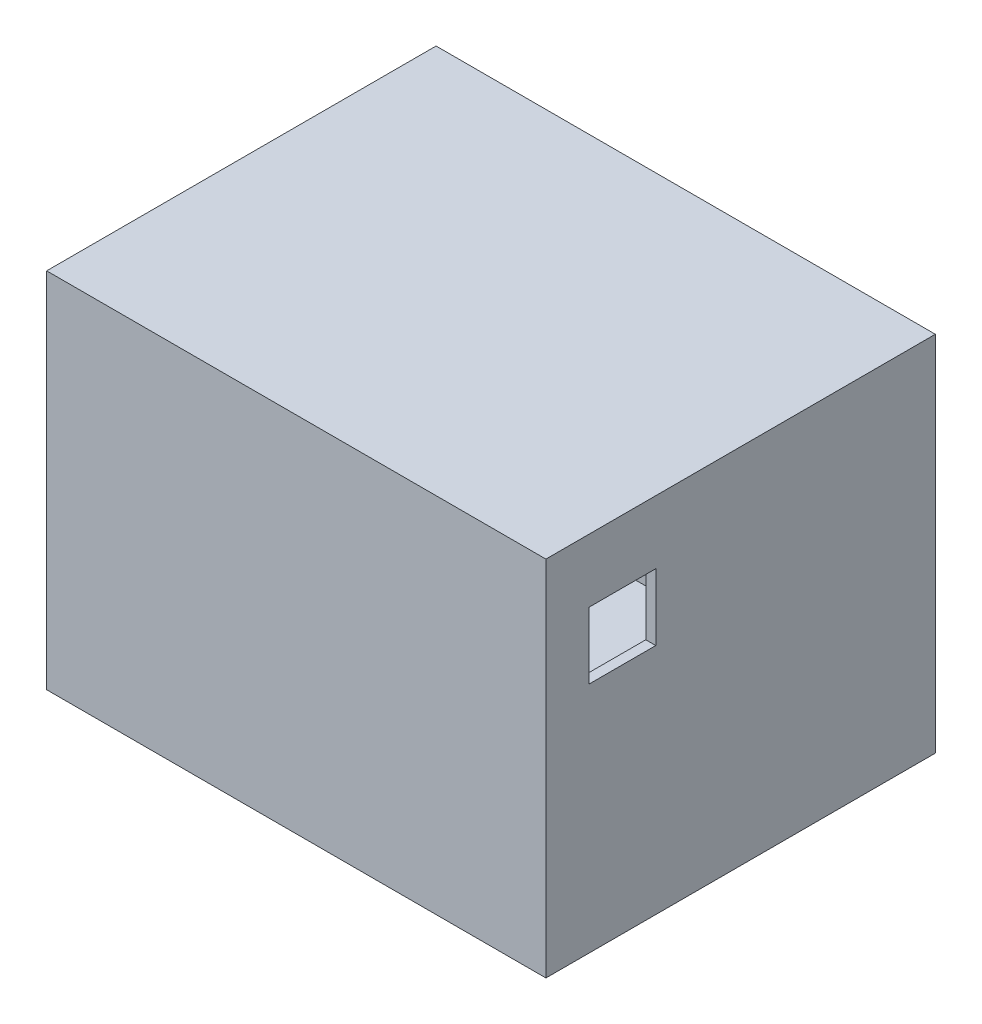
ISO-10303-21;
HEADER;
FILE_DESCRIPTION(('STEP AP214'),'2;1');
FILE_NAME('part.step','',(''),(''),'','','');
FILE_SCHEMA(('AUTOMOTIVE_DESIGN { 1 0 10303 214 1 1 1 1 }'));
ENDSEC;
DATA;
#1=APPLICATION_CONTEXT('core data for automotive mechanical design processes');
#2=APPLICATION_PROTOCOL_DEFINITION('international standard','automotive_design',2000,#1);
#3=PRODUCT_CONTEXT('',#1,'mechanical');
#4=PRODUCT('Part','Part','',(#3));
#5=PRODUCT_RELATED_PRODUCT_CATEGORY('part','',(#4));
#6=PRODUCT_DEFINITION_FORMATION('','',#4);
#7=PRODUCT_DEFINITION_CONTEXT('part definition',#1,'design');
#8=PRODUCT_DEFINITION('design','',#6,#7);
#9=PRODUCT_DEFINITION_SHAPE('','',#8);
#10=(LENGTH_UNIT() NAMED_UNIT(*) SI_UNIT(.MILLI.,.METRE.));
#11=(NAMED_UNIT(*) PLANE_ANGLE_UNIT() SI_UNIT($,.RADIAN.));
#12=(NAMED_UNIT(*) SI_UNIT($,.STERADIAN.) SOLID_ANGLE_UNIT());
#13=UNCERTAINTY_MEASURE_WITH_UNIT(LENGTH_MEASURE(1.E-05),#10,'distance_accuracy_value','');
#14=(GEOMETRIC_REPRESENTATION_CONTEXT(3) GLOBAL_UNCERTAINTY_ASSIGNED_CONTEXT((#13)) GLOBAL_UNIT_ASSIGNED_CONTEXT((#10,
#11,#12)) REPRESENTATION_CONTEXT('',''));
#15=CARTESIAN_POINT('',(0.,0.,0.));
#16=DIRECTION('',(0.,0.,1.));
#17=DIRECTION('',(1.,0.,0.));
#18=AXIS2_PLACEMENT_3D('',#15,#16,#17);
#19=CARTESIAN_POINT('',(-66.5581493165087,584.2,1846.68149316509));
#20=DIRECTION('',(1.,0.,0.));
#21=DIRECTION('',(0.,0.,-1.));
#22=AXIS2_PLACEMENT_3D('',#19,#20,#21);
#23=PLANE('',#22);
#24=DIRECTION('',(0.,-1.,0.));
#25=VECTOR('',#24,1.);
#26=CARTESIAN_POINT('',(-66.5581493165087,2324.1,1846.68149316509));
#27=LINE('',#26,#25);
#28=CARTESIAN_POINT('',(-66.5581493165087,2324.1,1846.68149316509));
#29=VERTEX_POINT('',#28);
#30=CARTESIAN_POINT('',(-66.5581493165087,584.2,1846.68149316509));
#31=VERTEX_POINT('',#30);
#32=EDGE_CURVE('E149',#29,#31,#27,.T.);
#33=ORIENTED_EDGE('',*,*,#32,.T.);
#34=DIRECTION('',(0.,0.,-1.));
#35=VECTOR('',#34,1.);
#36=CARTESIAN_POINT('',(-66.5581493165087,584.2,1846.68149316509));
#37=LINE('',#36,#35);
#38=CARTESIAN_POINT('',(-66.5581493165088,584.2,856.08149316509));
#39=VERTEX_POINT('',#38);
#40=EDGE_CURVE('E152',#31,#39,#37,.T.);
#41=ORIENTED_EDGE('',*,*,#40,.T.);
#42=DIRECTION('',(0.,1.,0.));
#43=VECTOR('',#42,1.);
#44=CARTESIAN_POINT('',(-66.5581493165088,2324.1,856.08149316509));
#45=LINE('',#44,#43);
#46=CARTESIAN_POINT('',(-66.5581493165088,2324.1,856.08149316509));
#47=VERTEX_POINT('',#46);
#48=EDGE_CURVE('E155',#39,#47,#45,.T.);
#49=ORIENTED_EDGE('',*,*,#48,.T.);
#50=DIRECTION('',(0.,0.,1.));
#51=VECTOR('',#50,1.);
#52=CARTESIAN_POINT('',(-66.5581493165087,2324.1,1846.68149316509));
#53=LINE('',#52,#51);
#54=EDGE_CURVE('E157',#47,#29,#53,.T.);
#55=ORIENTED_EDGE('',*,*,#54,.T.);
#56=EDGE_LOOP('',(#33,#41,#49,#55));
#57=FACE_BOUND('',#56,.T.);
#58=DIRECTION('',(0.,0.,-1.));
#59=VECTOR('',#58,1.);
#60=CARTESIAN_POINT('',(-66.5581493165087,673.1,1732.38149316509));
#61=LINE('',#60,#59);
#62=CARTESIAN_POINT('',(-66.5581493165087,673.1,1732.38149316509));
#63=VERTEX_POINT('',#62);
#64=CARTESIAN_POINT('',(-66.5581493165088,673.1,970.38149316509));
#65=VERTEX_POINT('',#64);
#66=EDGE_CURVE('E121',#63,#65,#61,.T.);
#67=ORIENTED_EDGE('',*,*,#66,.F.);
#68=DIRECTION('',(0.,-1.,0.));
#69=VECTOR('',#68,1.);
#70=CARTESIAN_POINT('',(-66.5581493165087,2197.1,1732.38149316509));
#71=LINE('',#70,#69);
#72=CARTESIAN_POINT('',(-66.5581493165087,2197.1,1732.38149316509));
#73=VERTEX_POINT('',#72);
#74=EDGE_CURVE('E113',#73,#63,#71,.T.);
#75=ORIENTED_EDGE('',*,*,#74,.F.);
#76=DIRECTION('',(0.,0.,1.));
#77=VECTOR('',#76,1.);
#78=CARTESIAN_POINT('',(-66.5581493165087,2197.1,1732.38149316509));
#79=LINE('',#78,#77);
#80=CARTESIAN_POINT('',(-66.5581493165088,2197.1,970.38149316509));
#81=VERTEX_POINT('',#80);
#82=EDGE_CURVE('E135',#81,#73,#79,.T.);
#83=ORIENTED_EDGE('',*,*,#82,.F.);
#84=DIRECTION('',(0.,1.,0.));
#85=VECTOR('',#84,1.);
#86=CARTESIAN_POINT('',(-66.5581493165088,2197.1,970.38149316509));
#87=LINE('',#86,#85);
#88=EDGE_CURVE('E133',#65,#81,#87,.T.);
#89=ORIENTED_EDGE('',*,*,#88,.F.);
#90=EDGE_LOOP('',(#67,#75,#83,#89));
#91=FACE_BOUND('',#90,.T.);
#92=ADVANCED_FACE('F48',(#57,#91),#23,.T.);
#93=CARTESIAN_POINT('',(-91.9581493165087,584.2,1846.68149316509));
#94=DIRECTION('',(1.,0.,0.));
#95=DIRECTION('',(0.,0.,-1.));
#96=AXIS2_PLACEMENT_3D('',#93,#94,#95);
#97=PLANE('',#96);
#98=DIRECTION('',(0.,-1.,0.));
#99=VECTOR('',#98,1.);
#100=CARTESIAN_POINT('',(-91.9581493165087,2324.1,1846.68149316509));
#101=LINE('',#100,#99);
#102=CARTESIAN_POINT('',(-91.9581493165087,2324.1,1846.68149316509));
#103=VERTEX_POINT('',#102);
#104=CARTESIAN_POINT('',(-91.9581493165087,584.2,1846.68149316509));
#105=VERTEX_POINT('',#104);
#106=EDGE_CURVE('E129',#103,#105,#101,.T.);
#107=ORIENTED_EDGE('',*,*,#106,.F.);
#108=DIRECTION('',(0.,0.,1.));
#109=VECTOR('',#108,1.);
#110=CARTESIAN_POINT('',(-91.9581493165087,2324.1,1846.68149316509));
#111=LINE('',#110,#109);
#112=CARTESIAN_POINT('',(-91.9581493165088,2324.1,856.08149316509));
#113=VERTEX_POINT('',#112);
#114=EDGE_CURVE('E153',#113,#103,#111,.T.);
#115=ORIENTED_EDGE('',*,*,#114,.F.);
#116=DIRECTION('',(0.,1.,0.));
#117=VECTOR('',#116,1.);
#118=CARTESIAN_POINT('',(-91.9581493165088,2324.1,856.08149316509));
#119=LINE('',#118,#117);
#120=CARTESIAN_POINT('',(-91.9581493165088,584.2,856.08149316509));
#121=VERTEX_POINT('',#120);
#122=EDGE_CURVE('E164',#121,#113,#119,.T.);
#123=ORIENTED_EDGE('',*,*,#122,.F.);
#124=DIRECTION('',(0.,0.,-1.));
#125=VECTOR('',#124,1.);
#126=CARTESIAN_POINT('',(-91.9581493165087,584.2,1846.68149316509));
#127=LINE('',#126,#125);
#128=EDGE_CURVE('E162',#105,#121,#127,.T.);
#129=ORIENTED_EDGE('',*,*,#128,.F.);
#130=EDGE_LOOP('',(#107,#115,#123,#129));
#131=FACE_BOUND('',#130,.T.);
#132=DIRECTION('',(0.,-1.,0.));
#133=VECTOR('',#132,1.);
#134=CARTESIAN_POINT('',(-91.9581493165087,2197.1,1732.38149316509));
#135=LINE('',#134,#133);
#136=CARTESIAN_POINT('',(-91.9581493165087,2197.1,1732.38149316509));
#137=VERTEX_POINT('',#136);
#138=CARTESIAN_POINT('',(-91.9581493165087,673.1,1732.38149316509));
#139=VERTEX_POINT('',#138);
#140=EDGE_CURVE('E71',#137,#139,#135,.T.);
#141=ORIENTED_EDGE('',*,*,#140,.T.);
#142=DIRECTION('',(0.,0.,-1.));
#143=VECTOR('',#142,1.);
#144=CARTESIAN_POINT('',(-91.9581493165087,673.1,1732.38149316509));
#145=LINE('',#144,#143);
#146=CARTESIAN_POINT('',(-91.9581493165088,673.1,970.38149316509));
#147=VERTEX_POINT('',#146);
#148=EDGE_CURVE('E128',#139,#147,#145,.T.);
#149=ORIENTED_EDGE('',*,*,#148,.T.);
#150=DIRECTION('',(0.,1.,0.));
#151=VECTOR('',#150,1.);
#152=CARTESIAN_POINT('',(-91.9581493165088,2197.1,970.38149316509));
#153=LINE('',#152,#151);
#154=CARTESIAN_POINT('',(-91.9581493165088,2197.1,970.38149316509));
#155=VERTEX_POINT('',#154);
#156=EDGE_CURVE('E141',#147,#155,#153,.T.);
#157=ORIENTED_EDGE('',*,*,#156,.T.);
#158=DIRECTION('',(0.,0.,1.));
#159=VECTOR('',#158,1.);
#160=CARTESIAN_POINT('',(-91.9581493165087,2197.1,1732.38149316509));
#161=LINE('',#160,#159);
#162=EDGE_CURVE('E122',#155,#137,#161,.T.);
#163=ORIENTED_EDGE('',*,*,#162,.T.);
#164=EDGE_LOOP('',(#141,#149,#157,#163));
#165=FACE_BOUND('',#164,.T.);
#166=ADVANCED_FACE('F182',(#131,#165),#97,.F.);
#167=CARTESIAN_POINT('',(-66.5581493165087,2324.1,1846.68149316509));
#168=DIRECTION('',(0.,0.,-1.));
#169=DIRECTION('',(0.,1.,0.));
#170=AXIS2_PLACEMENT_3D('',#167,#168,#169);
#171=PLANE('',#170);
#172=ORIENTED_EDGE('',*,*,#106,.T.);
#173=DIRECTION('',(-1.,0.,0.));
#174=VECTOR('',#173,1.);
#175=CARTESIAN_POINT('',(-66.5581493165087,584.2,1846.68149316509));
#176=LINE('',#175,#174);
#177=EDGE_CURVE('E12',#31,#105,#176,.T.);
#178=ORIENTED_EDGE('',*,*,#177,.F.);
#179=ORIENTED_EDGE('',*,*,#32,.F.);
#180=DIRECTION('',(-1.,0.,0.));
#181=VECTOR('',#180,1.);
#182=CARTESIAN_POINT('',(-66.5581493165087,2324.1,1846.68149316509));
#183=LINE('',#182,#181);
#184=EDGE_CURVE('E159',#29,#103,#183,.T.);
#185=ORIENTED_EDGE('',*,*,#184,.T.);
#186=EDGE_LOOP('',(#172,#178,#179,#185));
#187=FACE_BOUND('',#186,.T.);
#188=ADVANCED_FACE('F50',(#187),#171,.F.);
#189=CARTESIAN_POINT('',(-66.5581493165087,584.2,1846.68149316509));
#190=DIRECTION('',(0.,1.,0.));
#191=DIRECTION('',(0.,0.,1.));
#192=AXIS2_PLACEMENT_3D('',#189,#190,#191);
#193=PLANE('',#192);
#194=ORIENTED_EDGE('',*,*,#128,.T.);
#195=DIRECTION('',(-1.,0.,0.));
#196=VECTOR('',#195,1.);
#197=CARTESIAN_POINT('',(-66.5581493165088,584.2,856.08149316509));
#198=LINE('',#197,#196);
#199=EDGE_CURVE('E56',#39,#121,#198,.T.);
#200=ORIENTED_EDGE('',*,*,#199,.F.);
#201=ORIENTED_EDGE('',*,*,#40,.F.);
#202=ORIENTED_EDGE('',*,*,#177,.T.);
#203=EDGE_LOOP('',(#194,#200,#201,#202));
#204=FACE_BOUND('',#203,.T.);
#205=ADVANCED_FACE('F192',(#204),#193,.F.);
#206=CARTESIAN_POINT('',(-66.5581493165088,2324.1,856.08149316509));
#207=DIRECTION('',(0.,0.,1.));
#208=DIRECTION('',(1.,0.,0.));
#209=AXIS2_PLACEMENT_3D('',#206,#207,#208);
#210=PLANE('',#209);
#211=ORIENTED_EDGE('',*,*,#122,.T.);
#212=DIRECTION('',(-1.,0.,0.));
#213=VECTOR('',#212,1.);
#214=CARTESIAN_POINT('',(-66.5581493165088,2324.1,856.08149316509));
#215=LINE('',#214,#213);
#216=EDGE_CURVE('E169',#47,#113,#215,.T.);
#217=ORIENTED_EDGE('',*,*,#216,.F.);
#218=ORIENTED_EDGE('',*,*,#48,.F.);
#219=ORIENTED_EDGE('',*,*,#199,.T.);
#220=EDGE_LOOP('',(#211,#217,#218,#219));
#221=FACE_BOUND('',#220,.T.);
#222=ADVANCED_FACE('F176',(#221),#210,.F.);
#223=CARTESIAN_POINT('',(-66.5581493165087,2324.1,1846.68149316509));
#224=DIRECTION('',(0.,-1.,0.));
#225=DIRECTION('',(0.,0.,-1.));
#226=AXIS2_PLACEMENT_3D('',#223,#224,#225);
#227=PLANE('',#226);
#228=ORIENTED_EDGE('',*,*,#114,.T.);
#229=ORIENTED_EDGE('',*,*,#184,.F.);
#230=ORIENTED_EDGE('',*,*,#54,.F.);
#231=ORIENTED_EDGE('',*,*,#216,.T.);
#232=EDGE_LOOP('',(#228,#229,#230,#231));
#233=FACE_BOUND('',#232,.T.);
#234=ADVANCED_FACE('F186',(#233),#227,.F.);
#235=CARTESIAN_POINT('',(-66.5581493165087,2197.1,1732.38149316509));
#236=DIRECTION('',(0.,0.,-1.));
#237=DIRECTION('',(0.,1.,0.));
#238=AXIS2_PLACEMENT_3D('',#235,#236,#237);
#239=PLANE('',#238);
#240=ORIENTED_EDGE('',*,*,#140,.F.);
#241=DIRECTION('',(-1.,0.,0.));
#242=VECTOR('',#241,1.);
#243=CARTESIAN_POINT('',(-66.5581493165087,2197.1,1732.38149316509));
#244=LINE('',#243,#242);
#245=EDGE_CURVE('E117',#73,#137,#244,.T.);
#246=ORIENTED_EDGE('',*,*,#245,.F.);
#247=ORIENTED_EDGE('',*,*,#74,.T.);
#248=DIRECTION('',(-1.,0.,0.));
#249=VECTOR('',#248,1.);
#250=CARTESIAN_POINT('',(-66.5581493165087,673.1,1732.38149316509));
#251=LINE('',#250,#249);
#252=EDGE_CURVE('E116',#63,#139,#251,.T.);
#253=ORIENTED_EDGE('',*,*,#252,.T.);
#254=EDGE_LOOP('',(#240,#246,#247,#253));
#255=FACE_BOUND('',#254,.T.);
#256=ADVANCED_FACE('F115',(#255),#239,.T.);
#257=CARTESIAN_POINT('',(-66.5581493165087,673.1,1732.38149316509));
#258=DIRECTION('',(0.,1.,0.));
#259=DIRECTION('',(0.,0.,1.));
#260=AXIS2_PLACEMENT_3D('',#257,#258,#259);
#261=PLANE('',#260);
#262=ORIENTED_EDGE('',*,*,#148,.F.);
#263=ORIENTED_EDGE('',*,*,#252,.F.);
#264=ORIENTED_EDGE('',*,*,#66,.T.);
#265=DIRECTION('',(-1.,0.,0.));
#266=VECTOR('',#265,1.);
#267=CARTESIAN_POINT('',(-66.5581493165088,673.1,970.38149316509));
#268=LINE('',#267,#266);
#269=EDGE_CURVE('E130',#65,#147,#268,.T.);
#270=ORIENTED_EDGE('',*,*,#269,.T.);
#271=EDGE_LOOP('',(#262,#263,#264,#270));
#272=FACE_BOUND('',#271,.T.);
#273=ADVANCED_FACE('F125',(#272),#261,.T.);
#274=CARTESIAN_POINT('',(-66.5581493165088,2197.1,970.38149316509));
#275=DIRECTION('',(0.,0.,1.));
#276=DIRECTION('',(0.,-1.,0.));
#277=AXIS2_PLACEMENT_3D('',#274,#275,#276);
#278=PLANE('',#277);
#279=ORIENTED_EDGE('',*,*,#156,.F.);
#280=ORIENTED_EDGE('',*,*,#269,.F.);
#281=ORIENTED_EDGE('',*,*,#88,.T.);
#282=DIRECTION('',(-1.,0.,0.));
#283=VECTOR('',#282,1.);
#284=CARTESIAN_POINT('',(-66.5581493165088,2197.1,970.38149316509));
#285=LINE('',#284,#283);
#286=EDGE_CURVE('E63',#81,#155,#285,.T.);
#287=ORIENTED_EDGE('',*,*,#286,.T.);
#288=EDGE_LOOP('',(#279,#280,#281,#287));
#289=FACE_BOUND('',#288,.T.);
#290=ADVANCED_FACE('F215',(#289),#278,.T.);
#291=CARTESIAN_POINT('',(-66.5581493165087,2197.1,1732.38149316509));
#292=DIRECTION('',(0.,-1.,0.));
#293=DIRECTION('',(0.,0.,-1.));
#294=AXIS2_PLACEMENT_3D('',#291,#292,#293);
#295=PLANE('',#294);
#296=ORIENTED_EDGE('',*,*,#162,.F.);
#297=ORIENTED_EDGE('',*,*,#286,.F.);
#298=ORIENTED_EDGE('',*,*,#82,.T.);
#299=ORIENTED_EDGE('',*,*,#245,.T.);
#300=EDGE_LOOP('',(#296,#297,#298,#299));
#301=FACE_BOUND('',#300,.T.);
#302=ADVANCED_FACE('F219',(#301),#295,.T.);
#303=CLOSED_SHELL('',(#92,#166,#188,#205,#222,#234,#256,#273,#290,#302));
#304=MANIFOLD_SOLID_BREP('B2',#303);
#305=CARTESIAN_POINT('',(-168.158149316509,0.,2837.28149316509));
#306=DIRECTION('',(0.,1.,0.));
#307=DIRECTION('',(0.,0.,1.));
#308=AXIS2_PLACEMENT_3D('',#305,#306,#307);
#309=PLANE('',#308);
#310=DIRECTION('',(0.,0.,1.));
#311=VECTOR('',#310,1.);
#312=CARTESIAN_POINT('',(-168.158149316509,0.,-134.518506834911));
#313=LINE('',#312,#311);
#314=CARTESIAN_POINT('',(-168.158149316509,0.,-134.518506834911));
#315=VERTEX_POINT('',#314);
#316=CARTESIAN_POINT('',(-168.158149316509,0.,2837.28149316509));
#317=VERTEX_POINT('',#316);
#318=EDGE_CURVE('E432',#315,#317,#313,.T.);
#319=ORIENTED_EDGE('',*,*,#318,.F.);
#320=DIRECTION('',(-1.,0.,0.));
#321=VECTOR('',#320,1.);
#322=CARTESIAN_POINT('',(-168.158149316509,0.,-134.518506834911));
#323=LINE('',#322,#321);
#324=CARTESIAN_POINT('',(3641.84185068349,0.,-134.518506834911));
#325=VERTEX_POINT('',#324);
#326=EDGE_CURVE('E582',#325,#315,#323,.T.);
#327=ORIENTED_EDGE('',*,*,#326,.F.);
#328=DIRECTION('',(0.,0.,-1.));
#329=VECTOR('',#328,1.);
#330=CARTESIAN_POINT('',(3641.84185068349,0.,-134.518506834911));
#331=LINE('',#330,#329);
#332=CARTESIAN_POINT('',(3641.84185068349,0.,2837.28149316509));
#333=VERTEX_POINT('',#332);
#334=EDGE_CURVE('E580',#333,#325,#331,.T.);
#335=ORIENTED_EDGE('',*,*,#334,.F.);
#336=DIRECTION('',(1.,0.,0.));
#337=VECTOR('',#336,1.);
#338=CARTESIAN_POINT('',(-168.158149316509,0.,2837.28149316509));
#339=LINE('',#338,#337);
#340=EDGE_CURVE('E578',#317,#333,#339,.T.);
#341=ORIENTED_EDGE('',*,*,#340,.F.);
#342=EDGE_LOOP('',(#319,#327,#335,#341));
#343=FACE_BOUND('',#342,.T.);
#344=DIRECTION('',(0.,0.,1.));
#345=VECTOR('',#344,1.);
#346=CARTESIAN_POINT('',(-91.958149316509,0.,-58.3185068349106));
#347=LINE('',#346,#345);
#348=CARTESIAN_POINT('',(-91.958149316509,0.,-58.3185068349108));
#349=VERTEX_POINT('',#348);
#350=CARTESIAN_POINT('',(-91.9581493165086,0.,2761.08149316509));
#351=VERTEX_POINT('',#350);
#352=EDGE_CURVE('E543',#349,#351,#347,.T.);
#353=ORIENTED_EDGE('',*,*,#352,.T.);
#354=DIRECTION('',(1.,0.,0.));
#355=VECTOR('',#354,1.);
#356=CARTESIAN_POINT('',(-91.9581493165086,0.,2761.08149316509));
#357=LINE('',#356,#355);
#358=CARTESIAN_POINT('',(3565.64185068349,0.,2761.08149316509));
#359=VERTEX_POINT('',#358);
#360=EDGE_CURVE('E560',#351,#359,#357,.T.);
#361=ORIENTED_EDGE('',*,*,#360,.T.);
#362=DIRECTION('',(0.,0.,-1.));
#363=VECTOR('',#362,1.);
#364=CARTESIAN_POINT('',(3565.64185068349,0.,-58.3185068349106));
#365=LINE('',#364,#363);
#366=CARTESIAN_POINT('',(3565.64185068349,0.,-58.3185068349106));
#367=VERTEX_POINT('',#366);
#368=EDGE_CURVE('E563',#359,#367,#365,.T.);
#369=ORIENTED_EDGE('',*,*,#368,.T.);
#370=DIRECTION('',(-1.,0.,0.));
#371=VECTOR('',#370,1.);
#372=CARTESIAN_POINT('',(-91.958149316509,0.,-58.3185068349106));
#373=LINE('',#372,#371);
#374=EDGE_CURVE('E548',#367,#349,#373,.T.);
#375=ORIENTED_EDGE('',*,*,#374,.T.);
#376=EDGE_LOOP('',(#353,#361,#369,#375));
#377=FACE_BOUND('',#376,.T.);
#378=ADVANCED_FACE('F289',(#343,#377),#309,.F.);
#379=CARTESIAN_POINT('',(-168.158149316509,2692.4,-134.518506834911));
#380=DIRECTION('',(1.,0.,0.));
#381=DIRECTION('',(0.,0.,-1.));
#382=AXIS2_PLACEMENT_3D('',#379,#380,#381);
#383=PLANE('',#382);
#384=DIRECTION('',(0.,0.,-1.));
#385=VECTOR('',#384,1.);
#386=CARTESIAN_POINT('',(-168.158149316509,673.1,1732.38149316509));
#387=LINE('',#386,#385);
#388=CARTESIAN_POINT('',(-168.158149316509,673.1,1732.38149316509));
#389=VERTEX_POINT('',#388);
#390=CARTESIAN_POINT('',(-168.158149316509,673.1,970.38149316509));
#391=VERTEX_POINT('',#390);
#392=EDGE_CURVE('E490',#389,#391,#387,.T.);
#393=ORIENTED_EDGE('',*,*,#392,.T.);
#394=DIRECTION('',(0.,1.,0.));
#395=VECTOR('',#394,1.);
#396=CARTESIAN_POINT('',(-168.158149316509,673.1,970.38149316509));
#397=LINE('',#396,#395);
#398=CARTESIAN_POINT('',(-168.158149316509,2197.1,970.38149316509));
#399=VERTEX_POINT('',#398);
#400=EDGE_CURVE('E480',#391,#399,#397,.T.);
#401=ORIENTED_EDGE('',*,*,#400,.T.);
#402=DIRECTION('',(0.,0.,1.));
#403=VECTOR('',#402,1.);
#404=CARTESIAN_POINT('',(-168.158149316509,2197.1,970.38149316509));
#405=LINE('',#404,#403);
#406=CARTESIAN_POINT('',(-168.158149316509,2197.1,1732.38149316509));
#407=VERTEX_POINT('',#406);
#408=EDGE_CURVE('E483',#399,#407,#405,.T.);
#409=ORIENTED_EDGE('',*,*,#408,.T.);
#410=DIRECTION('',(0.,-1.,0.));
#411=VECTOR('',#410,1.);
#412=CARTESIAN_POINT('',(-168.158149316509,2197.1,1732.38149316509));
#413=LINE('',#412,#411);
#414=EDGE_CURVE('E487',#407,#389,#413,.T.);
#415=ORIENTED_EDGE('',*,*,#414,.T.);
#416=EDGE_LOOP('',(#393,#401,#409,#415));
#417=FACE_BOUND('',#416,.T.);
#418=ORIENTED_EDGE('',*,*,#318,.T.);
#419=DIRECTION('',(0.,-1.,0.));
#420=VECTOR('',#419,1.);
#421=CARTESIAN_POINT('',(-168.158149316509,2692.4,2837.28149316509));
#422=LINE('',#421,#420);
#423=CARTESIAN_POINT('',(-168.158149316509,2768.6,2837.28149316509));
#424=VERTEX_POINT('',#423);
#425=EDGE_CURVE('E46',#424,#317,#422,.T.);
#426=ORIENTED_EDGE('',*,*,#425,.F.);
#427=DIRECTION('',(0.,0.,1.));
#428=VECTOR('',#427,1.);
#429=CARTESIAN_POINT('',(-168.158149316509,2768.6,-134.518506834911));
#430=LINE('',#429,#428);
#431=CARTESIAN_POINT('',(-168.158149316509,2768.6,-134.518506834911));
#432=VERTEX_POINT('',#431);
#433=EDGE_CURVE('E430',#432,#424,#430,.T.);
#434=ORIENTED_EDGE('',*,*,#433,.F.);
#435=DIRECTION('',(0.,-1.,0.));
#436=VECTOR('',#435,1.);
#437=CARTESIAN_POINT('',(-168.158149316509,2692.4,-134.518506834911));
#438=LINE('',#437,#436);
#439=EDGE_CURVE('E584',#432,#315,#438,.T.);
#440=ORIENTED_EDGE('',*,*,#439,.T.);
#441=EDGE_LOOP('',(#418,#426,#434,#440));
#442=FACE_BOUND('',#441,.T.);
#443=ADVANCED_FACE('F291',(#417,#442),#383,.F.);
#444=CARTESIAN_POINT('',(-168.158149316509,2692.4,2837.28149316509));
#445=DIRECTION('',(0.,0.,-1.));
#446=DIRECTION('',(-1.,0.,0.));
#447=AXIS2_PLACEMENT_3D('',#444,#445,#446);
#448=PLANE('',#447);
#449=ORIENTED_EDGE('',*,*,#340,.T.);
#450=DIRECTION('',(0.,-1.,0.));
#451=VECTOR('',#450,1.);
#452=CARTESIAN_POINT('',(3641.84185068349,2692.4,2837.28149316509));
#453=LINE('',#452,#451);
#454=CARTESIAN_POINT('',(3641.84185068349,2768.6,2837.28149316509));
#455=VERTEX_POINT('',#454);
#456=EDGE_CURVE('E297',#455,#333,#453,.T.);
#457=ORIENTED_EDGE('',*,*,#456,.F.);
#458=DIRECTION('',(1.,0.,0.));
#459=VECTOR('',#458,1.);
#460=CARTESIAN_POINT('',(-168.158149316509,2768.6,2837.28149316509));
#461=LINE('',#460,#459);
#462=EDGE_CURVE('E435',#424,#455,#461,.T.);
#463=ORIENTED_EDGE('',*,*,#462,.F.);
#464=ORIENTED_EDGE('',*,*,#425,.T.);
#465=EDGE_LOOP('',(#449,#457,#463,#464));
#466=FACE_BOUND('',#465,.T.);
#467=ADVANCED_FACE('F436',(#466),#448,.F.);
#468=CARTESIAN_POINT('',(3641.84185068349,2692.4,-134.518506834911));
#469=DIRECTION('',(-1.,0.,0.));
#470=DIRECTION('',(0.,0.,1.));
#471=AXIS2_PLACEMENT_3D('',#468,#469,#470);
#472=PLANE('',#471);
#473=DIRECTION('',(0.,-1.,0.));
#474=VECTOR('',#473,1.);
#475=CARTESIAN_POINT('',(3641.84185068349,1778.,2507.08149316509));
#476=LINE('',#475,#474);
#477=CARTESIAN_POINT('',(3641.84185068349,2286.,2507.08149316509));
#478=VERTEX_POINT('',#477);
#479=CARTESIAN_POINT('',(3641.84185068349,1778.,2507.08149316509));
#480=VERTEX_POINT('',#479);
#481=EDGE_CURVE('E526',#478,#480,#476,.T.);
#482=ORIENTED_EDGE('',*,*,#481,.F.);
#483=DIRECTION('',(0.,0.,1.));
#484=VECTOR('',#483,1.);
#485=CARTESIAN_POINT('',(3641.84185068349,2286.,1999.08149316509));
#486=LINE('',#485,#484);
#487=CARTESIAN_POINT('',(3641.84185068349,2286.,1999.08149316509));
#488=VERTEX_POINT('',#487);
#489=EDGE_CURVE('E523',#488,#478,#486,.T.);
#490=ORIENTED_EDGE('',*,*,#489,.F.);
#491=DIRECTION('',(0.,1.,0.));
#492=VECTOR('',#491,1.);
#493=CARTESIAN_POINT('',(3641.84185068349,1778.,1999.08149316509));
#494=LINE('',#493,#492);
#495=CARTESIAN_POINT('',(3641.84185068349,1778.,1999.08149316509));
#496=VERTEX_POINT('',#495);
#497=EDGE_CURVE('E520',#496,#488,#494,.T.);
#498=ORIENTED_EDGE('',*,*,#497,.F.);
#499=DIRECTION('',(0.,0.,-1.));
#500=VECTOR('',#499,1.);
#501=CARTESIAN_POINT('',(3641.84185068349,1778.,1999.08149316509));
#502=LINE('',#501,#500);
#503=EDGE_CURVE('E529',#480,#496,#502,.T.);
#504=ORIENTED_EDGE('',*,*,#503,.F.);
#505=EDGE_LOOP('',(#482,#490,#498,#504));
#506=FACE_BOUND('',#505,.T.);
#507=ORIENTED_EDGE('',*,*,#334,.T.);
#508=DIRECTION('',(0.,-1.,0.));
#509=VECTOR('',#508,1.);
#510=CARTESIAN_POINT('',(3641.84185068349,2692.4,-134.518506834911));
#511=LINE('',#510,#509);
#512=CARTESIAN_POINT('',(3641.84185068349,2768.6,-134.518506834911));
#513=VERTEX_POINT('',#512);
#514=EDGE_CURVE('E586',#513,#325,#511,.T.);
#515=ORIENTED_EDGE('',*,*,#514,.F.);
#516=DIRECTION('',(0.,0.,-1.));
#517=VECTOR('',#516,1.);
#518=CARTESIAN_POINT('',(3641.84185068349,2768.6,-134.518506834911));
#519=LINE('',#518,#517);
#520=EDGE_CURVE('E441',#455,#513,#519,.T.);
#521=ORIENTED_EDGE('',*,*,#520,.F.);
#522=ORIENTED_EDGE('',*,*,#456,.T.);
#523=EDGE_LOOP('',(#507,#515,#521,#522));
#524=FACE_BOUND('',#523,.T.);
#525=ADVANCED_FACE('F590',(#506,#524),#472,.F.);
#526=CARTESIAN_POINT('',(-168.158149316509,2692.4,-134.518506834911));
#527=DIRECTION('',(0.,0.,1.));
#528=DIRECTION('',(1.,0.,0.));
#529=AXIS2_PLACEMENT_3D('',#526,#527,#528);
#530=PLANE('',#529);
#531=DIRECTION('',(-1.,0.,0.));
#532=VECTOR('',#531,1.);
#533=CARTESIAN_POINT('',(-168.158149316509,2108.2,-134.518506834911));
#534=LINE('',#533,#532);
#535=CARTESIAN_POINT('',(2441.69185068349,2108.2,-134.518506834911));
#536=VERTEX_POINT('',#535);
#537=CARTESIAN_POINT('',(1679.69185068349,2108.2,-134.518506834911));
#538=VERTEX_POINT('',#537);
#539=EDGE_CURVE('E473',#536,#538,#534,.T.);
#540=ORIENTED_EDGE('',*,*,#539,.T.);
#541=DIRECTION('',(0.,-1.,0.));
#542=VECTOR('',#541,1.);
#543=CARTESIAN_POINT('',(1679.69185068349,2692.4,-134.518506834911));
#544=LINE('',#543,#542);
#545=CARTESIAN_POINT('',(1679.69185068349,76.2,-134.518506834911));
#546=VERTEX_POINT('',#545);
#547=EDGE_CURVE('E476',#538,#546,#544,.T.);
#548=ORIENTED_EDGE('',*,*,#547,.T.);
#549=DIRECTION('',(1.,0.,0.));
#550=VECTOR('',#549,1.);
#551=CARTESIAN_POINT('',(-168.158149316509,76.2,-134.518506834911));
#552=LINE('',#551,#550);
#553=CARTESIAN_POINT('',(2441.69185068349,76.2000000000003,-134.518506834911));
#554=VERTEX_POINT('',#553);
#555=EDGE_CURVE('E463',#546,#554,#552,.T.);
#556=ORIENTED_EDGE('',*,*,#555,.T.);
#557=DIRECTION('',(0.,1.,0.));
#558=VECTOR('',#557,1.);
#559=CARTESIAN_POINT('',(2441.69185068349,2692.4,-134.518506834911));
#560=LINE('',#559,#558);
#561=EDGE_CURVE('E470',#554,#536,#560,.T.);
#562=ORIENTED_EDGE('',*,*,#561,.T.);
#563=EDGE_LOOP('',(#540,#548,#556,#562));
#564=FACE_BOUND('',#563,.T.);
#565=ORIENTED_EDGE('',*,*,#326,.T.);
#566=ORIENTED_EDGE('',*,*,#439,.F.);
#567=DIRECTION('',(-1.,0.,0.));
#568=VECTOR('',#567,1.);
#569=CARTESIAN_POINT('',(-168.158149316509,2768.6,-134.518506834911));
#570=LINE('',#569,#568);
#571=EDGE_CURVE('E446',#513,#432,#570,.T.);
#572=ORIENTED_EDGE('',*,*,#571,.F.);
#573=ORIENTED_EDGE('',*,*,#514,.T.);
#574=EDGE_LOOP('',(#565,#566,#572,#573));
#575=FACE_BOUND('',#574,.T.);
#576=ADVANCED_FACE('F595',(#564,#575),#530,.F.);
#577=CARTESIAN_POINT('',(-91.958149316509,2692.4,-58.3185068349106));
#578=DIRECTION('',(1.,0.,0.));
#579=DIRECTION('',(0.,0.,-1.));
#580=AXIS2_PLACEMENT_3D('',#577,#578,#579);
#581=PLANE('',#580);
#582=DIRECTION('',(0.,1.,0.));
#583=VECTOR('',#582,1.);
#584=CARTESIAN_POINT('',(-91.9581493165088,673.1,970.38149316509));
#585=LINE('',#584,#583);
#586=CARTESIAN_POINT('',(-91.9581493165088,673.1,970.38149316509));
#587=VERTEX_POINT('',#586);
#588=CARTESIAN_POINT('',(-91.9581493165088,2197.1,970.38149316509));
#589=VERTEX_POINT('',#588);
#590=EDGE_CURVE('E479',#587,#589,#585,.T.);
#591=ORIENTED_EDGE('',*,*,#590,.F.);
#592=DIRECTION('',(0.,0.,-1.));
#593=VECTOR('',#592,1.);
#594=CARTESIAN_POINT('',(-91.9581493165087,673.1,1732.38149316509));
#595=LINE('',#594,#593);
#596=CARTESIAN_POINT('',(-91.9581493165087,673.1,1732.38149316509));
#597=VERTEX_POINT('',#596);
#598=EDGE_CURVE('E484',#597,#587,#595,.T.);
#599=ORIENTED_EDGE('',*,*,#598,.F.);
#600=DIRECTION('',(0.,-1.,0.));
#601=VECTOR('',#600,1.);
#602=CARTESIAN_POINT('',(-91.9581493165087,2197.1,1732.38149316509));
#603=LINE('',#602,#601);
#604=CARTESIAN_POINT('',(-91.9581493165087,2197.1,1732.38149316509));
#605=VERTEX_POINT('',#604);
#606=EDGE_CURVE('E498',#605,#597,#603,.T.);
#607=ORIENTED_EDGE('',*,*,#606,.F.);
#608=DIRECTION('',(0.,0.,1.));
#609=VECTOR('',#608,1.);
#610=CARTESIAN_POINT('',(-91.9581493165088,2197.1,970.38149316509));
#611=LINE('',#610,#609);
#612=EDGE_CURVE('E495',#589,#605,#611,.T.);
#613=ORIENTED_EDGE('',*,*,#612,.F.);
#614=EDGE_LOOP('',(#591,#599,#607,#613));
#615=FACE_BOUND('',#614,.T.);
#616=ORIENTED_EDGE('',*,*,#352,.F.);
#617=DIRECTION('',(0.,-1.,0.));
#618=VECTOR('',#617,1.);
#619=CARTESIAN_POINT('',(-91.958149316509,2692.4,-58.3185068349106));
#620=LINE('',#619,#618);
#621=CARTESIAN_POINT('',(-91.958149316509,2692.4,-58.3185068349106));
#622=VERTEX_POINT('',#621);
#623=EDGE_CURVE('E557',#622,#349,#620,.T.);
#624=ORIENTED_EDGE('',*,*,#623,.F.);
#625=DIRECTION('',(0.,0.,1.));
#626=VECTOR('',#625,1.);
#627=CARTESIAN_POINT('',(-91.958149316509,2692.4,-58.3185068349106));
#628=LINE('',#627,#626);
#629=CARTESIAN_POINT('',(-91.9581493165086,2692.4,2761.08149316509));
#630=VERTEX_POINT('',#629);
#631=EDGE_CURVE('E544',#622,#630,#628,.T.);
#632=ORIENTED_EDGE('',*,*,#631,.T.);
#633=DIRECTION('',(0.,-1.,0.));
#634=VECTOR('',#633,1.);
#635=CARTESIAN_POINT('',(-91.9581493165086,2692.4,2761.08149316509));
#636=LINE('',#635,#634);
#637=EDGE_CURVE('E574',#630,#351,#636,.T.);
#638=ORIENTED_EDGE('',*,*,#637,.T.);
#639=EDGE_LOOP('',(#616,#624,#632,#638));
#640=FACE_BOUND('',#639,.T.);
#641=ADVANCED_FACE('F597',(#615,#640),#581,.T.);
#642=CARTESIAN_POINT('',(-91.9581493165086,2692.4,2761.08149316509));
#643=DIRECTION('',(0.,0.,-1.));
#644=DIRECTION('',(-1.,0.,0.));
#645=AXIS2_PLACEMENT_3D('',#642,#643,#644);
#646=PLANE('',#645);
#647=ORIENTED_EDGE('',*,*,#360,.F.);
#648=ORIENTED_EDGE('',*,*,#637,.F.);
#649=DIRECTION('',(1.,0.,0.));
#650=VECTOR('',#649,1.);
#651=CARTESIAN_POINT('',(-91.9581493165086,2692.4,2761.08149316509));
#652=LINE('',#651,#650);
#653=CARTESIAN_POINT('',(3565.64185068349,2692.4,2761.08149316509));
#654=VERTEX_POINT('',#653);
#655=EDGE_CURVE('E547',#630,#654,#652,.T.);
#656=ORIENTED_EDGE('',*,*,#655,.T.);
#657=DIRECTION('',(0.,-1.,0.));
#658=VECTOR('',#657,1.);
#659=CARTESIAN_POINT('',(3565.64185068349,2692.4,2761.08149316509));
#660=LINE('',#659,#658);
#661=EDGE_CURVE('E572',#654,#359,#660,.T.);
#662=ORIENTED_EDGE('',*,*,#661,.T.);
#663=EDGE_LOOP('',(#647,#648,#656,#662));
#664=FACE_BOUND('',#663,.T.);
#665=ADVANCED_FACE('F604',(#664),#646,.T.);
#666=CARTESIAN_POINT('',(3565.64185068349,2692.4,-58.3185068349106));
#667=DIRECTION('',(-1.,0.,0.));
#668=DIRECTION('',(0.,0.,1.));
#669=AXIS2_PLACEMENT_3D('',#666,#667,#668);
#670=PLANE('',#669);
#671=DIRECTION('',(0.,0.,1.));
#672=VECTOR('',#671,1.);
#673=CARTESIAN_POINT('',(3565.64185068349,2286.,1999.08149316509));
#674=LINE('',#673,#672);
#675=CARTESIAN_POINT('',(3565.64185068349,2286.,1999.08149316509));
#676=VERTEX_POINT('',#675);
#677=CARTESIAN_POINT('',(3565.64185068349,2286.,2507.08149316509));
#678=VERTEX_POINT('',#677);
#679=EDGE_CURVE('E535',#676,#678,#674,.T.);
#680=ORIENTED_EDGE('',*,*,#679,.T.);
#681=DIRECTION('',(0.,-1.,0.));
#682=VECTOR('',#681,1.);
#683=CARTESIAN_POINT('',(3565.64185068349,1778.,2507.08149316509));
#684=LINE('',#683,#682);
#685=CARTESIAN_POINT('',(3565.64185068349,1778.,2507.08149316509));
#686=VERTEX_POINT('',#685);
#687=EDGE_CURVE('E505',#678,#686,#684,.T.);
#688=ORIENTED_EDGE('',*,*,#687,.T.);
#689=DIRECTION('',(0.,0.,-1.));
#690=VECTOR('',#689,1.);
#691=CARTESIAN_POINT('',(3565.64185068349,1778.,1999.08149316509));
#692=LINE('',#691,#690);
#693=CARTESIAN_POINT('',(3565.64185068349,1778.,1999.08149316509));
#694=VERTEX_POINT('',#693);
#695=EDGE_CURVE('E514',#686,#694,#692,.T.);
#696=ORIENTED_EDGE('',*,*,#695,.T.);
#697=DIRECTION('',(0.,1.,0.));
#698=VECTOR('',#697,1.);
#699=CARTESIAN_POINT('',(3565.64185068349,1778.,1999.08149316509));
#700=LINE('',#699,#698);
#701=EDGE_CURVE('E517',#694,#676,#700,.T.);
#702=ORIENTED_EDGE('',*,*,#701,.T.);
#703=EDGE_LOOP('',(#680,#688,#696,#702));
#704=FACE_BOUND('',#703,.T.);
#705=ORIENTED_EDGE('',*,*,#368,.F.);
#706=ORIENTED_EDGE('',*,*,#661,.F.);
#707=DIRECTION('',(0.,0.,-1.));
#708=VECTOR('',#707,1.);
#709=CARTESIAN_POINT('',(3565.64185068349,2692.4,-58.3185068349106));
#710=LINE('',#709,#708);
#711=CARTESIAN_POINT('',(3565.64185068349,2692.4,-58.3185068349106));
#712=VERTEX_POINT('',#711);
#713=EDGE_CURVE('E551',#654,#712,#710,.T.);
#714=ORIENTED_EDGE('',*,*,#713,.T.);
#715=DIRECTION('',(0.,-1.,0.));
#716=VECTOR('',#715,1.);
#717=CARTESIAN_POINT('',(3565.64185068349,2692.4,-58.3185068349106));
#718=LINE('',#717,#716);
#719=EDGE_CURVE('E570',#712,#367,#718,.T.);
#720=ORIENTED_EDGE('',*,*,#719,.T.);
#721=EDGE_LOOP('',(#705,#706,#714,#720));
#722=FACE_BOUND('',#721,.T.);
#723=ADVANCED_FACE('F618',(#704,#722),#670,.T.);
#724=CARTESIAN_POINT('',(-91.958149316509,2692.4,-58.3185068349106));
#725=DIRECTION('',(0.,0.,1.));
#726=DIRECTION('',(1.,0.,0.));
#727=AXIS2_PLACEMENT_3D('',#724,#725,#726);
#728=PLANE('',#727);
#729=DIRECTION('',(0.,-1.,0.));
#730=VECTOR('',#729,1.);
#731=CARTESIAN_POINT('',(1679.69185068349,2108.2,-58.3185068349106));
#732=LINE('',#731,#730);
#733=CARTESIAN_POINT('',(1679.69185068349,2108.2,-58.3185068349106));
#734=VERTEX_POINT('',#733);
#735=CARTESIAN_POINT('',(1679.69185068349,76.2000000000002,-58.3185068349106));
#736=VERTEX_POINT('',#735);
#737=EDGE_CURVE('E312',#734,#736,#732,.T.);
#738=ORIENTED_EDGE('',*,*,#737,.F.);
#739=DIRECTION('',(-1.,0.,0.));
#740=VECTOR('',#739,1.);
#741=CARTESIAN_POINT('',(1679.69185068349,2108.2,-58.3185068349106));
#742=LINE('',#741,#740);
#743=CARTESIAN_POINT('',(2441.69185068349,2108.2,-58.3185068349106));
#744=VERTEX_POINT('',#743);
#745=EDGE_CURVE('E457',#744,#734,#742,.T.);
#746=ORIENTED_EDGE('',*,*,#745,.F.);
#747=DIRECTION('',(0.,1.,0.));
#748=VECTOR('',#747,1.);
#749=CARTESIAN_POINT('',(2441.69185068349,2108.2,-58.3185068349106));
#750=LINE('',#749,#748);
#751=CARTESIAN_POINT('',(2441.69185068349,76.2000000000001,-58.3185068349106));
#752=VERTEX_POINT('',#751);
#753=EDGE_CURVE('E454',#752,#744,#750,.T.);
#754=ORIENTED_EDGE('',*,*,#753,.F.);
#755=DIRECTION('',(1.,0.,0.));
#756=VECTOR('',#755,1.);
#757=CARTESIAN_POINT('',(1679.69185068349,76.2,-58.3185068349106));
#758=LINE('',#757,#756);
#759=EDGE_CURVE('E452',#736,#752,#758,.T.);
#760=ORIENTED_EDGE('',*,*,#759,.F.);
#761=EDGE_LOOP('',(#738,#746,#754,#760));
#762=FACE_BOUND('',#761,.T.);
#763=ORIENTED_EDGE('',*,*,#374,.F.);
#764=ORIENTED_EDGE('',*,*,#719,.F.);
#765=DIRECTION('',(-1.,0.,0.));
#766=VECTOR('',#765,1.);
#767=CARTESIAN_POINT('',(-91.958149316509,2692.4,-58.3185068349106));
#768=LINE('',#767,#766);
#769=EDGE_CURVE('E554',#712,#622,#768,.T.);
#770=ORIENTED_EDGE('',*,*,#769,.T.);
#771=ORIENTED_EDGE('',*,*,#623,.T.);
#772=EDGE_LOOP('',(#763,#764,#770,#771));
#773=FACE_BOUND('',#772,.T.);
#774=ADVANCED_FACE('F622',(#762,#773),#728,.T.);
#775=CARTESIAN_POINT('',(-168.159149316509,2286.,1999.08149316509));
#776=DIRECTION('',(0.,1.,0.));
#777=DIRECTION('',(0.,0.,1.));
#778=AXIS2_PLACEMENT_3D('',#775,#776,#777);
#779=PLANE('',#778);
#780=DIRECTION('',(1.,0.,0.));
#781=VECTOR('',#780,1.);
#782=CARTESIAN_POINT('',(-168.159149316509,2286.,1999.08149316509));
#783=LINE('',#782,#781);
#784=EDGE_CURVE('E531',#676,#488,#783,.T.);
#785=ORIENTED_EDGE('',*,*,#784,.T.);
#786=ORIENTED_EDGE('',*,*,#489,.T.);
#787=DIRECTION('',(1.,0.,0.));
#788=VECTOR('',#787,1.);
#789=CARTESIAN_POINT('',(-168.159149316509,2286.,2507.08149316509));
#790=LINE('',#789,#788);
#791=EDGE_CURVE('E538',#678,#478,#790,.T.);
#792=ORIENTED_EDGE('',*,*,#791,.F.);
#793=ORIENTED_EDGE('',*,*,#679,.F.);
#794=EDGE_LOOP('',(#785,#786,#792,#793));
#795=FACE_BOUND('',#794,.T.);
#796=ADVANCED_FACE('F626',(#795),#779,.F.);
#797=CARTESIAN_POINT('',(-168.159149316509,1778.,2507.08149316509));
#798=DIRECTION('',(0.,0.,1.));
#799=DIRECTION('',(1.,0.,0.));
#800=AXIS2_PLACEMENT_3D('',#797,#798,#799);
#801=PLANE('',#800);
#802=ORIENTED_EDGE('',*,*,#791,.T.);
#803=ORIENTED_EDGE('',*,*,#481,.T.);
#804=DIRECTION('',(1.,0.,0.));
#805=VECTOR('',#804,1.);
#806=CARTESIAN_POINT('',(-168.159149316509,1778.,2507.08149316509));
#807=LINE('',#806,#805);
#808=EDGE_CURVE('E536',#686,#480,#807,.T.);
#809=ORIENTED_EDGE('',*,*,#808,.F.);
#810=ORIENTED_EDGE('',*,*,#687,.F.);
#811=EDGE_LOOP('',(#802,#803,#809,#810));
#812=FACE_BOUND('',#811,.T.);
#813=ADVANCED_FACE('F636',(#812),#801,.F.);
#814=CARTESIAN_POINT('',(-168.159149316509,1778.,1999.08149316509));
#815=DIRECTION('',(0.,-1.,0.));
#816=DIRECTION('',(0.,0.,-1.));
#817=AXIS2_PLACEMENT_3D('',#814,#815,#816);
#818=PLANE('',#817);
#819=ORIENTED_EDGE('',*,*,#808,.T.);
#820=ORIENTED_EDGE('',*,*,#503,.T.);
#821=DIRECTION('',(1.,0.,0.));
#822=VECTOR('',#821,1.);
#823=CARTESIAN_POINT('',(-168.159149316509,1778.,1999.08149316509));
#824=LINE('',#823,#822);
#825=EDGE_CURVE('E532',#694,#496,#824,.T.);
#826=ORIENTED_EDGE('',*,*,#825,.F.);
#827=ORIENTED_EDGE('',*,*,#695,.F.);
#828=EDGE_LOOP('',(#819,#820,#826,#827));
#829=FACE_BOUND('',#828,.T.);
#830=ADVANCED_FACE('F632',(#829),#818,.F.);
#831=CARTESIAN_POINT('',(-168.159149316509,1778.,1999.08149316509));
#832=DIRECTION('',(0.,0.,-1.));
#833=DIRECTION('',(-1.,0.,0.));
#834=AXIS2_PLACEMENT_3D('',#831,#832,#833);
#835=PLANE('',#834);
#836=ORIENTED_EDGE('',*,*,#825,.T.);
#837=ORIENTED_EDGE('',*,*,#497,.T.);
#838=ORIENTED_EDGE('',*,*,#784,.F.);
#839=ORIENTED_EDGE('',*,*,#701,.F.);
#840=EDGE_LOOP('',(#836,#837,#838,#839));
#841=FACE_BOUND('',#840,.T.);
#842=ADVANCED_FACE('F628',(#841),#835,.F.);
#843=CARTESIAN_POINT('',(-168.158149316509,673.1,970.38149316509));
#844=DIRECTION('',(0.,0.,-1.));
#845=DIRECTION('',(0.,1.,0.));
#846=AXIS2_PLACEMENT_3D('',#843,#844,#845);
#847=PLANE('',#846);
#848=ORIENTED_EDGE('',*,*,#590,.T.);
#849=DIRECTION('',(1.,0.,0.));
#850=VECTOR('',#849,1.);
#851=CARTESIAN_POINT('',(-168.158149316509,2197.1,970.38149316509));
#852=LINE('',#851,#850);
#853=EDGE_CURVE('E493',#399,#589,#852,.T.);
#854=ORIENTED_EDGE('',*,*,#853,.F.);
#855=ORIENTED_EDGE('',*,*,#400,.F.);
#856=DIRECTION('',(1.,0.,0.));
#857=VECTOR('',#856,1.);
#858=CARTESIAN_POINT('',(-168.158149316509,673.1,970.38149316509));
#859=LINE('',#858,#857);
#860=EDGE_CURVE('E503',#391,#587,#859,.T.);
#861=ORIENTED_EDGE('',*,*,#860,.T.);
#862=EDGE_LOOP('',(#848,#854,#855,#861));
#863=FACE_BOUND('',#862,.T.);
#864=ADVANCED_FACE('F631',(#863),#847,.F.);
#865=CARTESIAN_POINT('',(-168.158149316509,673.1,1732.38149316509));
#866=DIRECTION('',(0.,-1.,0.));
#867=DIRECTION('',(0.,0.,-1.));
#868=AXIS2_PLACEMENT_3D('',#865,#866,#867);
#869=PLANE('',#868);
#870=ORIENTED_EDGE('',*,*,#598,.T.);
#871=ORIENTED_EDGE('',*,*,#860,.F.);
#872=ORIENTED_EDGE('',*,*,#392,.F.);
#873=DIRECTION('',(1.,0.,0.));
#874=VECTOR('',#873,1.);
#875=CARTESIAN_POINT('',(-168.158149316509,673.1,1732.38149316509));
#876=LINE('',#875,#874);
#877=EDGE_CURVE('E506',#389,#597,#876,.T.);
#878=ORIENTED_EDGE('',*,*,#877,.T.);
#879=EDGE_LOOP('',(#870,#871,#872,#878));
#880=FACE_BOUND('',#879,.T.);
#881=ADVANCED_FACE('F646',(#880),#869,.F.);
#882=CARTESIAN_POINT('',(-168.158149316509,2197.1,1732.38149316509));
#883=DIRECTION('',(0.,0.,1.));
#884=DIRECTION('',(0.,-1.,0.));
#885=AXIS2_PLACEMENT_3D('',#882,#883,#884);
#886=PLANE('',#885);
#887=ORIENTED_EDGE('',*,*,#606,.T.);
#888=ORIENTED_EDGE('',*,*,#877,.F.);
#889=ORIENTED_EDGE('',*,*,#414,.F.);
#890=DIRECTION('',(1.,0.,0.));
#891=VECTOR('',#890,1.);
#892=CARTESIAN_POINT('',(-168.158149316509,2197.1,1732.38149316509));
#893=LINE('',#892,#891);
#894=EDGE_CURVE('E508',#407,#605,#893,.T.);
#895=ORIENTED_EDGE('',*,*,#894,.T.);
#896=EDGE_LOOP('',(#887,#888,#889,#895));
#897=FACE_BOUND('',#896,.T.);
#898=ADVANCED_FACE('F652',(#897),#886,.F.);
#899=CARTESIAN_POINT('',(-168.158149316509,2197.1,970.38149316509));
#900=DIRECTION('',(0.,1.,0.));
#901=DIRECTION('',(0.,0.,1.));
#902=AXIS2_PLACEMENT_3D('',#899,#900,#901);
#903=PLANE('',#902);
#904=ORIENTED_EDGE('',*,*,#612,.T.);
#905=ORIENTED_EDGE('',*,*,#894,.F.);
#906=ORIENTED_EDGE('',*,*,#408,.F.);
#907=ORIENTED_EDGE('',*,*,#853,.T.);
#908=EDGE_LOOP('',(#904,#905,#906,#907));
#909=FACE_BOUND('',#908,.T.);
#910=ADVANCED_FACE('F648',(#909),#903,.F.);
#911=CARTESIAN_POINT('',(1679.69185068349,2108.2,-158.318506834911));
#912=DIRECTION('',(-1.,0.,0.));
#913=DIRECTION('',(0.,-1.,0.));
#914=AXIS2_PLACEMENT_3D('',#911,#912,#913);
#915=PLANE('',#914);
#916=DIRECTION('',(0.,0.,1.));
#917=VECTOR('',#916,1.);
#918=CARTESIAN_POINT('',(1679.69185068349,2108.2,-158.318506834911));
#919=LINE('',#918,#917);
#920=EDGE_CURVE('E461',#538,#734,#919,.T.);
#921=ORIENTED_EDGE('',*,*,#920,.T.);
#922=ORIENTED_EDGE('',*,*,#737,.T.);
#923=DIRECTION('',(0.,0.,1.));
#924=VECTOR('',#923,1.);
#925=CARTESIAN_POINT('',(1679.69185068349,76.2,-158.318506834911));
#926=LINE('',#925,#924);
#927=EDGE_CURVE('E460',#546,#736,#926,.T.);
#928=ORIENTED_EDGE('',*,*,#927,.F.);
#929=ORIENTED_EDGE('',*,*,#547,.F.);
#930=EDGE_LOOP('',(#921,#922,#928,#929));
#931=FACE_BOUND('',#930,.T.);
#932=ADVANCED_FACE('F651',(#931),#915,.F.);
#933=CARTESIAN_POINT('',(1679.69185068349,2108.2,-158.318506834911));
#934=DIRECTION('',(0.,1.,0.));
#935=DIRECTION('',(-1.,0.,0.));
#936=AXIS2_PLACEMENT_3D('',#933,#934,#935);
#937=PLANE('',#936);
#938=DIRECTION('',(0.,0.,1.));
#939=VECTOR('',#938,1.);
#940=CARTESIAN_POINT('',(2441.69185068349,2108.2,-158.318506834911));
#941=LINE('',#940,#939);
#942=EDGE_CURVE('E464',#536,#744,#941,.T.);
#943=ORIENTED_EDGE('',*,*,#942,.T.);
#944=ORIENTED_EDGE('',*,*,#745,.T.);
#945=ORIENTED_EDGE('',*,*,#920,.F.);
#946=ORIENTED_EDGE('',*,*,#539,.F.);
#947=EDGE_LOOP('',(#943,#944,#945,#946));
#948=FACE_BOUND('',#947,.T.);
#949=ADVANCED_FACE('F662',(#948),#937,.F.);
#950=CARTESIAN_POINT('',(2441.69185068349,2108.2,-158.318506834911));
#951=DIRECTION('',(1.,0.,0.));
#952=DIRECTION('',(0.,1.,0.));
#953=AXIS2_PLACEMENT_3D('',#950,#951,#952);
#954=PLANE('',#953);
#955=DIRECTION('',(0.,0.,1.));
#956=VECTOR('',#955,1.);
#957=CARTESIAN_POINT('',(2441.69185068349,76.2000000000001,-158.318506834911));
#958=LINE('',#957,#956);
#959=EDGE_CURVE('E304',#554,#752,#958,.T.);
#960=ORIENTED_EDGE('',*,*,#959,.T.);
#961=ORIENTED_EDGE('',*,*,#753,.T.);
#962=ORIENTED_EDGE('',*,*,#942,.F.);
#963=ORIENTED_EDGE('',*,*,#561,.F.);
#964=EDGE_LOOP('',(#960,#961,#962,#963));
#965=FACE_BOUND('',#964,.T.);
#966=ADVANCED_FACE('F667',(#965),#954,.F.);
#967=CARTESIAN_POINT('',(1679.69185068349,76.2,-158.318506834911));
#968=DIRECTION('',(0.,-1.,0.));
#969=DIRECTION('',(1.,0.,0.));
#970=AXIS2_PLACEMENT_3D('',#967,#968,#969);
#971=PLANE('',#970);
#972=ORIENTED_EDGE('',*,*,#927,.T.);
#973=ORIENTED_EDGE('',*,*,#759,.T.);
#974=ORIENTED_EDGE('',*,*,#959,.F.);
#975=ORIENTED_EDGE('',*,*,#555,.F.);
#976=EDGE_LOOP('',(#972,#973,#974,#975));
#977=FACE_BOUND('',#976,.T.);
#978=ADVANCED_FACE('F663',(#977),#971,.F.);
#979=CARTESIAN_POINT('',(-168.158149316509,2692.4,2837.28149316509));
#980=DIRECTION('',(0.,1.,0.));
#981=DIRECTION('',(0.,0.,1.));
#982=AXIS2_PLACEMENT_3D('',#979,#980,#981);
#983=PLANE('',#982);
#984=ORIENTED_EDGE('',*,*,#631,.F.);
#985=ORIENTED_EDGE('',*,*,#769,.F.);
#986=ORIENTED_EDGE('',*,*,#713,.F.);
#987=ORIENTED_EDGE('',*,*,#655,.F.);
#988=EDGE_LOOP('',(#984,#985,#986,#987));
#989=FACE_BOUND('',#988,.T.);
#990=ADVANCED_FACE('F666',(#989),#983,.F.);
#991=CARTESIAN_POINT('',(-168.158149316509,2768.6,2837.28149316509));
#992=DIRECTION('',(0.,1.,0.));
#993=DIRECTION('',(0.,0.,1.));
#994=AXIS2_PLACEMENT_3D('',#991,#992,#993);
#995=PLANE('',#994);
#996=ORIENTED_EDGE('',*,*,#433,.T.);
#997=ORIENTED_EDGE('',*,*,#462,.T.);
#998=ORIENTED_EDGE('',*,*,#520,.T.);
#999=ORIENTED_EDGE('',*,*,#571,.T.);
#1000=EDGE_LOOP('',(#996,#997,#998,#999));
#1001=FACE_BOUND('',#1000,.T.);
#1002=ADVANCED_FACE('F444',(#1001),#995,.T.);
#1003=CLOSED_SHELL('',(#378,#443,#467,#525,#576,#641,#665,#723,#774,#796,#813,#830,#842,#864,
#881,#898,#910,#932,#949,#966,#978,#990,#1002));
#1004=MANIFOLD_SOLID_BREP('B6',#1003);
#1005=CARTESIAN_POINT('',(-91.958149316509,76.2,-58.3185068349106));
#1006=DIRECTION('',(1.,0.,0.));
#1007=DIRECTION('',(0.,0.,-1.));
#1008=AXIS2_PLACEMENT_3D('',#1005,#1006,#1007);
#1009=PLANE('',#1008);
#1010=DIRECTION('',(0.,0.,1.));
#1011=VECTOR('',#1010,1.);
#1012=CARTESIAN_POINT('',(-91.958149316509,0.,-58.3185068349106));
#1013=LINE('',#1012,#1011);
#1014=CARTESIAN_POINT('',(-91.958149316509,0.,-58.3185068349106));
#1015=VERTEX_POINT('',#1014);
#1016=CARTESIAN_POINT('',(-91.9581493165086,0.,2761.08149316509));
#1017=VERTEX_POINT('',#1016);
#1018=EDGE_CURVE('E931',#1015,#1017,#1013,.T.);
#1019=ORIENTED_EDGE('',*,*,#1018,.T.);
#1020=DIRECTION('',(0.,-1.,0.));
#1021=VECTOR('',#1020,1.);
#1022=CARTESIAN_POINT('',(-91.9581493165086,76.2,2761.08149316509));
#1023=LINE('',#1022,#1021);
#1024=CARTESIAN_POINT('',(-91.9581493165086,76.2,2761.08149316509));
#1025=VERTEX_POINT('',#1024);
#1026=EDGE_CURVE('E287',#1025,#1017,#1023,.T.);
#1027=ORIENTED_EDGE('',*,*,#1026,.F.);
#1028=DIRECTION('',(0.,0.,1.));
#1029=VECTOR('',#1028,1.);
#1030=CARTESIAN_POINT('',(-91.958149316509,76.2,-58.3185068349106));
#1031=LINE('',#1030,#1029);
#1032=CARTESIAN_POINT('',(-91.958149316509,76.2,-58.3185068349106));
#1033=VERTEX_POINT('',#1032);
#1034=EDGE_CURVE('E919',#1033,#1025,#1031,.T.);
#1035=ORIENTED_EDGE('',*,*,#1034,.F.);
#1036=DIRECTION('',(0.,-1.,0.));
#1037=VECTOR('',#1036,1.);
#1038=CARTESIAN_POINT('',(-91.958149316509,76.2,-58.3185068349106));
#1039=LINE('',#1038,#1037);
#1040=EDGE_CURVE('E927',#1033,#1015,#1039,.T.);
#1041=ORIENTED_EDGE('',*,*,#1040,.T.);
#1042=EDGE_LOOP('',(#1019,#1027,#1035,#1041));
#1043=FACE_BOUND('',#1042,.T.);
#1044=ADVANCED_FACE('F868',(#1043),#1009,.F.);
#1045=CARTESIAN_POINT('',(-91.9581493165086,76.2,2761.08149316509));
#1046=DIRECTION('',(0.,0.,-1.));
#1047=DIRECTION('',(-1.,0.,0.));
#1048=AXIS2_PLACEMENT_3D('',#1045,#1046,#1047);
#1049=PLANE('',#1048);
#1050=DIRECTION('',(1.,0.,0.));
#1051=VECTOR('',#1050,1.);
#1052=CARTESIAN_POINT('',(-91.9581493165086,0.,2761.08149316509));
#1053=LINE('',#1052,#1051);
#1054=CARTESIAN_POINT('',(3565.64185068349,0.,2761.08149316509));
#1055=VERTEX_POINT('',#1054);
#1056=EDGE_CURVE('E923',#1017,#1055,#1053,.T.);
#1057=ORIENTED_EDGE('',*,*,#1056,.T.);
#1058=DIRECTION('',(0.,-1.,0.));
#1059=VECTOR('',#1058,1.);
#1060=CARTESIAN_POINT('',(3565.64185068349,76.2,2761.08149316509));
#1061=LINE('',#1060,#1059);
#1062=CARTESIAN_POINT('',(3565.64185068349,76.2,2761.08149316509));
#1063=VERTEX_POINT('',#1062);
#1064=EDGE_CURVE('E876',#1063,#1055,#1061,.T.);
#1065=ORIENTED_EDGE('',*,*,#1064,.F.);
#1066=DIRECTION('',(1.,0.,0.));
#1067=VECTOR('',#1066,1.);
#1068=CARTESIAN_POINT('',(-91.9581493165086,76.2,2761.08149316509));
#1069=LINE('',#1068,#1067);
#1070=EDGE_CURVE('E914',#1025,#1063,#1069,.T.);
#1071=ORIENTED_EDGE('',*,*,#1070,.F.);
#1072=ORIENTED_EDGE('',*,*,#1026,.T.);
#1073=EDGE_LOOP('',(#1057,#1065,#1071,#1072));
#1074=FACE_BOUND('',#1073,.T.);
#1075=ADVANCED_FACE('F922',(#1074),#1049,.F.);
#1076=CARTESIAN_POINT('',(3565.64185068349,76.2,-58.3185068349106));
#1077=DIRECTION('',(-1.,0.,0.));
#1078=DIRECTION('',(0.,0.,1.));
#1079=AXIS2_PLACEMENT_3D('',#1076,#1077,#1078);
#1080=PLANE('',#1079);
#1081=DIRECTION('',(0.,0.,-1.));
#1082=VECTOR('',#1081,1.);
#1083=CARTESIAN_POINT('',(3565.64185068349,0.,-58.3185068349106));
#1084=LINE('',#1083,#1082);
#1085=CARTESIAN_POINT('',(3565.64185068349,0.,-58.3185068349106));
#1086=VERTEX_POINT('',#1085);
#1087=EDGE_CURVE('E901',#1055,#1086,#1084,.T.);
#1088=ORIENTED_EDGE('',*,*,#1087,.T.);
#1089=DIRECTION('',(0.,-1.,0.));
#1090=VECTOR('',#1089,1.);
#1091=CARTESIAN_POINT('',(3565.64185068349,76.2,-58.3185068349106));
#1092=LINE('',#1091,#1090);
#1093=CARTESIAN_POINT('',(3565.64185068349,76.2,-58.3185068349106));
#1094=VERTEX_POINT('',#1093);
#1095=EDGE_CURVE('E924',#1094,#1086,#1092,.T.);
#1096=ORIENTED_EDGE('',*,*,#1095,.F.);
#1097=DIRECTION('',(0.,0.,-1.));
#1098=VECTOR('',#1097,1.);
#1099=CARTESIAN_POINT('',(3565.64185068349,76.2,-58.3185068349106));
#1100=LINE('',#1099,#1098);
#1101=EDGE_CURVE('E917',#1063,#1094,#1100,.T.);
#1102=ORIENTED_EDGE('',*,*,#1101,.F.);
#1103=ORIENTED_EDGE('',*,*,#1064,.T.);
#1104=EDGE_LOOP('',(#1088,#1096,#1102,#1103));
#1105=FACE_BOUND('',#1104,.T.);
#1106=ADVANCED_FACE('F925',(#1105),#1080,.F.);
#1107=CARTESIAN_POINT('',(-91.958149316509,76.2,-58.3185068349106));
#1108=DIRECTION('',(0.,0.,1.));
#1109=DIRECTION('',(1.,0.,0.));
#1110=AXIS2_PLACEMENT_3D('',#1107,#1108,#1109);
#1111=PLANE('',#1110);
#1112=DIRECTION('',(-1.,0.,0.));
#1113=VECTOR('',#1112,1.);
#1114=CARTESIAN_POINT('',(-91.958149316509,0.,-58.3185068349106));
#1115=LINE('',#1114,#1113);
#1116=EDGE_CURVE('E907',#1086,#1015,#1115,.T.);
#1117=ORIENTED_EDGE('',*,*,#1116,.T.);
#1118=ORIENTED_EDGE('',*,*,#1040,.F.);
#1119=DIRECTION('',(-1.,0.,0.));
#1120=VECTOR('',#1119,1.);
#1121=CARTESIAN_POINT('',(-91.958149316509,76.2,-58.3185068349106));
#1122=LINE('',#1121,#1120);
#1123=EDGE_CURVE('E884',#1094,#1033,#1122,.T.);
#1124=ORIENTED_EDGE('',*,*,#1123,.F.);
#1125=ORIENTED_EDGE('',*,*,#1095,.T.);
#1126=EDGE_LOOP('',(#1117,#1118,#1124,#1125));
#1127=FACE_BOUND('',#1126,.T.);
#1128=ADVANCED_FACE('F938',(#1127),#1111,.F.);
#1129=CARTESIAN_POINT('',(-91.9581493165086,76.2,2761.08149316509));
#1130=DIRECTION('',(0.,1.,0.));
#1131=DIRECTION('',(0.,0.,1.));
#1132=AXIS2_PLACEMENT_3D('',#1129,#1130,#1131);
#1133=PLANE('',#1132);
#1134=ORIENTED_EDGE('',*,*,#1034,.T.);
#1135=ORIENTED_EDGE('',*,*,#1070,.T.);
#1136=ORIENTED_EDGE('',*,*,#1101,.T.);
#1137=ORIENTED_EDGE('',*,*,#1123,.T.);
#1138=EDGE_LOOP('',(#1134,#1135,#1136,#1137));
#1139=FACE_BOUND('',#1138,.T.);
#1140=ADVANCED_FACE('F915',(#1139),#1133,.T.);
#1141=CARTESIAN_POINT('',(-91.9581493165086,0.,2761.08149316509));
#1142=DIRECTION('',(0.,1.,0.));
#1143=DIRECTION('',(0.,0.,1.));
#1144=AXIS2_PLACEMENT_3D('',#1141,#1142,#1143);
#1145=PLANE('',#1144);
#1146=ORIENTED_EDGE('',*,*,#1018,.F.);
#1147=ORIENTED_EDGE('',*,*,#1116,.F.);
#1148=ORIENTED_EDGE('',*,*,#1087,.F.);
#1149=ORIENTED_EDGE('',*,*,#1056,.F.);
#1150=EDGE_LOOP('',(#1146,#1147,#1148,#1149));
#1151=FACE_BOUND('',#1150,.T.);
#1152=ADVANCED_FACE('F941',(#1151),#1145,.F.);
#1153=CLOSED_SHELL('',(#1044,#1075,#1106,#1128,#1140,#1152));
#1154=MANIFOLD_SOLID_BREP('B40',#1153);
#1155=ADVANCED_BREP_SHAPE_REPRESENTATION('',(#18,#304,#1004,#1154),#14);
#1156=SHAPE_DEFINITION_REPRESENTATION(#9,#1155);
ENDSEC;
END-ISO-10303-21;
